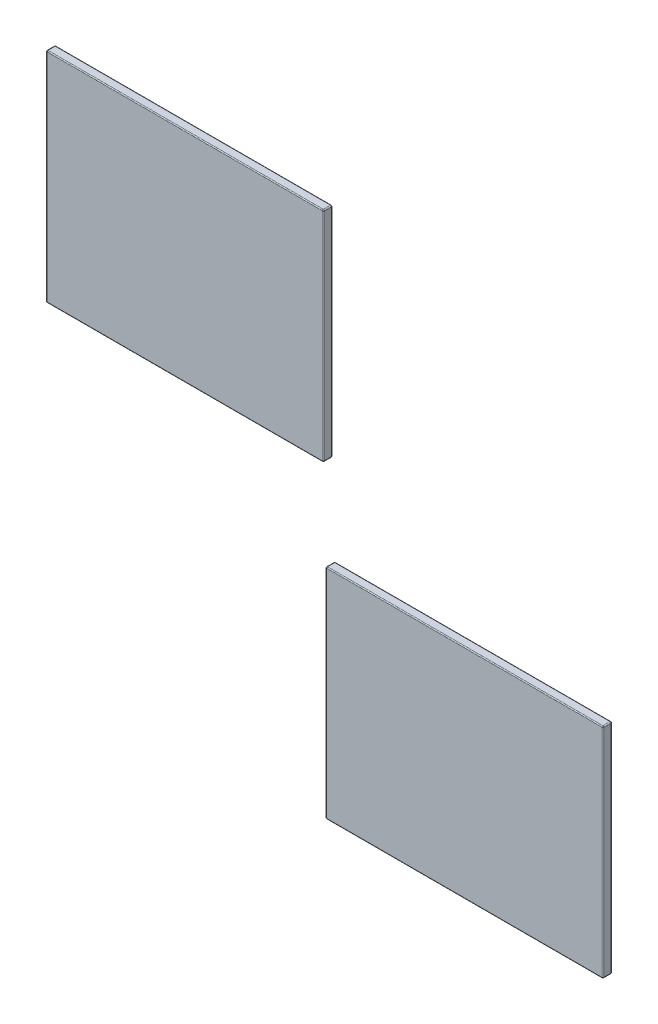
ISO-10303-21;
HEADER;
FILE_DESCRIPTION(('STEP AP214'),'2;1');
FILE_NAME('part.step','',(''),(''),'','','');
FILE_SCHEMA(('AUTOMOTIVE_DESIGN { 1 0 10303 214 1 1 1 1 }'));
ENDSEC;
DATA;
#1=APPLICATION_CONTEXT('core data for automotive mechanical design processes');
#2=APPLICATION_PROTOCOL_DEFINITION('international standard','automotive_design',2000,#1);
#3=PRODUCT_CONTEXT('',#1,'mechanical');
#4=PRODUCT('Part','Part','',(#3));
#5=PRODUCT_RELATED_PRODUCT_CATEGORY('part','',(#4));
#6=PRODUCT_DEFINITION_FORMATION('','',#4);
#7=PRODUCT_DEFINITION_CONTEXT('part definition',#1,'design');
#8=PRODUCT_DEFINITION('design','',#6,#7);
#9=PRODUCT_DEFINITION_SHAPE('','',#8);
#10=(LENGTH_UNIT() NAMED_UNIT(*) SI_UNIT(.MILLI.,.METRE.));
#11=(NAMED_UNIT(*) PLANE_ANGLE_UNIT() SI_UNIT($,.RADIAN.));
#12=(NAMED_UNIT(*) SI_UNIT($,.STERADIAN.) SOLID_ANGLE_UNIT());
#13=UNCERTAINTY_MEASURE_WITH_UNIT(LENGTH_MEASURE(1.E-05),#10,'distance_accuracy_value','');
#14=(GEOMETRIC_REPRESENTATION_CONTEXT(3) GLOBAL_UNCERTAINTY_ASSIGNED_CONTEXT((#13)) GLOBAL_UNIT_ASSIGNED_CONTEXT((#10,
#11,#12)) REPRESENTATION_CONTEXT('',''));
#15=CARTESIAN_POINT('',(0.,0.,0.));
#16=DIRECTION('',(0.,0.,1.));
#17=DIRECTION('',(1.,0.,0.));
#18=AXIS2_PLACEMENT_3D('',#15,#16,#17);
#19=CARTESIAN_POINT('',(-5.,690.,-20.));
#20=DIRECTION('',(1.,0.,0.));
#21=DIRECTION('',(0.,0.,-1.));
#22=AXIS2_PLACEMENT_3D('',#19,#20,#21);
#23=PLANE('',#22);
#24=DIRECTION('',(0.,0.,1.));
#25=VECTOR('',#24,1.);
#26=CARTESIAN_POINT('',(-5.,692.5,-20.));
#27=LINE('',#26,#25);
#28=CARTESIAN_POINT('',(-5.,692.5,-2.));
#29=VERTEX_POINT('',#28);
#30=CARTESIAN_POINT('',(-5.,692.5,-18.));
#31=VERTEX_POINT('',#30);
#32=EDGE_CURVE('E175',#29,#31,#27,.F.);
#33=ORIENTED_EDGE('',*,*,#32,.T.);
#34=DIRECTION('',(0.,1.,0.));
#35=VECTOR('',#34,1.);
#36=CARTESIAN_POINT('',(-5.,1177.5,-18.));
#37=LINE('',#36,#35);
#38=CARTESIAN_POINT('',(-5.,1177.5,-18.));
#39=VERTEX_POINT('',#38);
#40=EDGE_CURVE('E191',#31,#39,#37,.T.);
#41=ORIENTED_EDGE('',*,*,#40,.T.);
#42=DIRECTION('',(0.,0.,1.));
#43=VECTOR('',#42,1.);
#44=CARTESIAN_POINT('',(-5.,1177.5,-20.));
#45=LINE('',#44,#43);
#46=CARTESIAN_POINT('',(-5.,1177.5,-2.));
#47=VERTEX_POINT('',#46);
#48=EDGE_CURVE('E304',#39,#47,#45,.T.);
#49=ORIENTED_EDGE('',*,*,#48,.T.);
#50=DIRECTION('',(0.,1.,0.));
#51=VECTOR('',#50,1.);
#52=CARTESIAN_POINT('',(-5.,690.,-2.));
#53=LINE('',#52,#51);
#54=EDGE_CURVE('E189',#47,#29,#53,.F.);
#55=ORIENTED_EDGE('',*,*,#54,.T.);
#56=EDGE_LOOP('',(#33,#41,#49,#55));
#57=FACE_BOUND('',#56,.T.);
#58=ADVANCED_FACE('F42',(#57),#23,.T.);
#59=CARTESIAN_POINT('',(-5.,690.,-20.));
#60=DIRECTION('',(0.,-1.,0.));
#61=DIRECTION('',(0.,0.,-1.));
#62=AXIS2_PLACEMENT_3D('',#59,#60,#61);
#63=PLANE('',#62);
#64=DIRECTION('',(0.,0.,1.));
#65=VECTOR('',#64,1.);
#66=CARTESIAN_POINT('',(-625.,690.,-20.));
#67=LINE('',#66,#65);
#68=CARTESIAN_POINT('',(-625.,690.,-2.));
#69=VERTEX_POINT('',#68);
#70=CARTESIAN_POINT('',(-625.,690.,-18.));
#71=VERTEX_POINT('',#70);
#72=EDGE_CURVE('E290',#69,#71,#67,.F.);
#73=ORIENTED_EDGE('',*,*,#72,.T.);
#74=DIRECTION('',(1.,0.,0.));
#75=VECTOR('',#74,1.);
#76=CARTESIAN_POINT('',(-7.5,690.,-18.));
#77=LINE('',#76,#75);
#78=CARTESIAN_POINT('',(-7.5,690.,-18.));
#79=VERTEX_POINT('',#78);
#80=EDGE_CURVE('E216',#71,#79,#77,.T.);
#81=ORIENTED_EDGE('',*,*,#80,.T.);
#82=DIRECTION('',(0.,0.,1.));
#83=VECTOR('',#82,1.);
#84=CARTESIAN_POINT('',(-7.5,690.,-20.));
#85=LINE('',#84,#83);
#86=CARTESIAN_POINT('',(-7.5,690.,-2.));
#87=VERTEX_POINT('',#86);
#88=EDGE_CURVE('E284',#79,#87,#85,.T.);
#89=ORIENTED_EDGE('',*,*,#88,.T.);
#90=DIRECTION('',(1.,0.,0.));
#91=VECTOR('',#90,1.);
#92=CARTESIAN_POINT('',(-5.,690.,-2.));
#93=LINE('',#92,#91);
#94=EDGE_CURVE('E214',#87,#69,#93,.F.);
#95=ORIENTED_EDGE('',*,*,#94,.T.);
#96=EDGE_LOOP('',(#73,#81,#89,#95));
#97=FACE_BOUND('',#96,.T.);
#98=ADVANCED_FACE('F288',(#97),#63,.T.);
#99=CARTESIAN_POINT('',(-627.5,690.,-20.));
#100=DIRECTION('',(-1.,0.,0.));
#101=DIRECTION('',(0.,0.,1.));
#102=AXIS2_PLACEMENT_3D('',#99,#100,#101);
#103=PLANE('',#102);
#104=DIRECTION('',(0.,0.,1.));
#105=VECTOR('',#104,1.);
#106=CARTESIAN_POINT('',(-627.5,1177.5,-20.));
#107=LINE('',#106,#105);
#108=CARTESIAN_POINT('',(-627.5,1177.5,-2.));
#109=VERTEX_POINT('',#108);
#110=CARTESIAN_POINT('',(-627.5,1177.5,-18.));
#111=VERTEX_POINT('',#110);
#112=EDGE_CURVE('E247',#109,#111,#107,.F.);
#113=ORIENTED_EDGE('',*,*,#112,.T.);
#114=DIRECTION('',(0.,-1.,0.));
#115=VECTOR('',#114,1.);
#116=CARTESIAN_POINT('',(-627.5,692.5,-18.));
#117=LINE('',#116,#115);
#118=CARTESIAN_POINT('',(-627.5,692.5,-18.));
#119=VERTEX_POINT('',#118);
#120=EDGE_CURVE('E208',#111,#119,#117,.T.);
#121=ORIENTED_EDGE('',*,*,#120,.T.);
#122=DIRECTION('',(0.,0.,1.));
#123=VECTOR('',#122,1.);
#124=CARTESIAN_POINT('',(-627.5,692.5,-20.));
#125=LINE('',#124,#123);
#126=CARTESIAN_POINT('',(-627.5,692.5,-2.));
#127=VERTEX_POINT('',#126);
#128=EDGE_CURVE('E291',#119,#127,#125,.T.);
#129=ORIENTED_EDGE('',*,*,#128,.T.);
#130=DIRECTION('',(0.,-1.,0.));
#131=VECTOR('',#130,1.);
#132=CARTESIAN_POINT('',(-627.5,690.,-2.));
#133=LINE('',#132,#131);
#134=EDGE_CURVE('E206',#127,#109,#133,.F.);
#135=ORIENTED_EDGE('',*,*,#134,.T.);
#136=EDGE_LOOP('',(#113,#121,#129,#135));
#137=FACE_BOUND('',#136,.T.);
#138=ADVANCED_FACE('F354',(#137),#103,.T.);
#139=CARTESIAN_POINT('',(-5.,1180.,-20.));
#140=DIRECTION('',(0.,1.,0.));
#141=DIRECTION('',(0.,0.,1.));
#142=AXIS2_PLACEMENT_3D('',#139,#140,#141);
#143=PLANE('',#142);
#144=DIRECTION('',(0.,0.,1.));
#145=VECTOR('',#144,1.);
#146=CARTESIAN_POINT('',(-7.5,1180.,-20.));
#147=LINE('',#146,#145);
#148=CARTESIAN_POINT('',(-7.5,1180.,-2.));
#149=VERTEX_POINT('',#148);
#150=CARTESIAN_POINT('',(-7.5,1180.,-18.));
#151=VERTEX_POINT('',#150);
#152=EDGE_CURVE('E293',#149,#151,#147,.F.);
#153=ORIENTED_EDGE('',*,*,#152,.T.);
#154=DIRECTION('',(-1.,0.,0.));
#155=VECTOR('',#154,1.);
#156=CARTESIAN_POINT('',(-625.,1180.,-18.));
#157=LINE('',#156,#155);
#158=CARTESIAN_POINT('',(-625.,1180.,-18.));
#159=VERTEX_POINT('',#158);
#160=EDGE_CURVE('E199',#151,#159,#157,.T.);
#161=ORIENTED_EDGE('',*,*,#160,.T.);
#162=DIRECTION('',(0.,0.,1.));
#163=VECTOR('',#162,1.);
#164=CARTESIAN_POINT('',(-625.,1180.,-20.));
#165=LINE('',#164,#163);
#166=CARTESIAN_POINT('',(-625.,1180.,-2.));
#167=VERTEX_POINT('',#166);
#168=EDGE_CURVE('E301',#159,#167,#165,.T.);
#169=ORIENTED_EDGE('',*,*,#168,.T.);
#170=DIRECTION('',(-1.,0.,0.));
#171=VECTOR('',#170,1.);
#172=CARTESIAN_POINT('',(-5.,1180.,-2.));
#173=LINE('',#172,#171);
#174=EDGE_CURVE('E197',#167,#149,#173,.F.);
#175=ORIENTED_EDGE('',*,*,#174,.T.);
#176=EDGE_LOOP('',(#153,#161,#169,#175));
#177=FACE_BOUND('',#176,.T.);
#178=ADVANCED_FACE('F370',(#177),#143,.T.);
#179=CARTESIAN_POINT('',(-5.,1180.,-20.));
#180=DIRECTION('',(0.,0.,1.));
#181=DIRECTION('',(1.,0.,0.));
#182=AXIS2_PLACEMENT_3D('',#179,#180,#181);
#183=PLANE('',#182);
#184=DIRECTION('',(0.,1.,0.));
#185=VECTOR('',#184,1.);
#186=CARTESIAN_POINT('',(-7.,692.5,-20.));
#187=LINE('',#186,#185);
#188=CARTESIAN_POINT('',(-7.,1177.5,-20.));
#189=VERTEX_POINT('',#188);
#190=CARTESIAN_POINT('',(-7.,692.5,-20.));
#191=VERTEX_POINT('',#190);
#192=EDGE_CURVE('E179',#189,#191,#187,.F.);
#193=ORIENTED_EDGE('',*,*,#192,.T.);
#194=CARTESIAN_POINT('',(-7.5,692.5,-20.));
#195=DIRECTION('',(0.,0.,1.));
#196=DIRECTION('',(1.,0.,0.));
#197=AXIS2_PLACEMENT_3D('',#194,#195,#196);
#198=CIRCLE('',#197,0.5);
#199=CARTESIAN_POINT('',(-7.5,692.,-20.));
#200=VERTEX_POINT('',#199);
#201=EDGE_CURVE('E160',#191,#200,#198,.F.);
#202=ORIENTED_EDGE('',*,*,#201,.T.);
#203=DIRECTION('',(1.,0.,0.));
#204=VECTOR('',#203,1.);
#205=CARTESIAN_POINT('',(-625.,692.,-20.));
#206=LINE('',#205,#204);
#207=CARTESIAN_POINT('',(-625.,692.,-20.));
#208=VERTEX_POINT('',#207);
#209=EDGE_CURVE('E168',#200,#208,#206,.F.);
#210=ORIENTED_EDGE('',*,*,#209,.T.);
#211=CARTESIAN_POINT('',(-625.,692.5,-20.));
#212=DIRECTION('',(0.,0.,1.));
#213=DIRECTION('',(1.,0.,0.));
#214=AXIS2_PLACEMENT_3D('',#211,#212,#213);
#215=CIRCLE('',#214,0.5);
#216=CARTESIAN_POINT('',(-625.5,692.5,-20.));
#217=VERTEX_POINT('',#216);
#218=EDGE_CURVE('E174',#208,#217,#215,.F.);
#219=ORIENTED_EDGE('',*,*,#218,.T.);
#220=DIRECTION('',(0.,-1.,0.));
#221=VECTOR('',#220,1.);
#222=CARTESIAN_POINT('',(-625.5,1177.5,-20.));
#223=LINE('',#222,#221);
#224=CARTESIAN_POINT('',(-625.5,1177.5,-20.));
#225=VERTEX_POINT('',#224);
#226=EDGE_CURVE('E309',#217,#225,#223,.F.);
#227=ORIENTED_EDGE('',*,*,#226,.T.);
#228=CARTESIAN_POINT('',(-625.,1177.5,-20.));
#229=DIRECTION('',(0.,0.,1.));
#230=DIRECTION('',(1.,0.,0.));
#231=AXIS2_PLACEMENT_3D('',#228,#229,#230);
#232=CIRCLE('',#231,0.5);
#233=CARTESIAN_POINT('',(-625.,1178.,-20.));
#234=VERTEX_POINT('',#233);
#235=EDGE_CURVE('E311',#225,#234,#232,.F.);
#236=ORIENTED_EDGE('',*,*,#235,.T.);
#237=DIRECTION('',(-1.,0.,0.));
#238=VECTOR('',#237,1.);
#239=CARTESIAN_POINT('',(-7.5,1178.,-20.));
#240=LINE('',#239,#238);
#241=CARTESIAN_POINT('',(-7.5,1178.,-20.));
#242=VERTEX_POINT('',#241);
#243=EDGE_CURVE('E313',#234,#242,#240,.F.);
#244=ORIENTED_EDGE('',*,*,#243,.T.);
#245=CARTESIAN_POINT('',(-7.5,1177.5,-20.));
#246=DIRECTION('',(0.,0.,1.));
#247=DIRECTION('',(1.,0.,0.));
#248=AXIS2_PLACEMENT_3D('',#245,#246,#247);
#249=CIRCLE('',#248,0.5);
#250=EDGE_CURVE('E184',#242,#189,#249,.F.);
#251=ORIENTED_EDGE('',*,*,#250,.T.);
#252=EDGE_LOOP('',(#193,#202,#210,#219,#227,#236,#244,#251));
#253=FACE_BOUND('',#252,.T.);
#254=ADVANCED_FACE('F177',(#253),#183,.F.);
#255=CARTESIAN_POINT('',(-5.,1180.,0.));
#256=DIRECTION('',(0.,0.,1.));
#257=DIRECTION('',(1.,0.,0.));
#258=AXIS2_PLACEMENT_3D('',#255,#256,#257);
#259=PLANE('',#258);
#260=DIRECTION('',(-1.,0.,0.));
#261=VECTOR('',#260,1.);
#262=CARTESIAN_POINT('',(-5.,1178.,0.));
#263=LINE('',#262,#261);
#264=CARTESIAN_POINT('',(-7.5,1178.,0.));
#265=VERTEX_POINT('',#264);
#266=CARTESIAN_POINT('',(-625.,1178.,0.));
#267=VERTEX_POINT('',#266);
#268=EDGE_CURVE('E51',#265,#267,#263,.T.);
#269=ORIENTED_EDGE('',*,*,#268,.T.);
#270=CARTESIAN_POINT('',(-625.,1177.5,0.));
#271=DIRECTION('',(0.,0.,1.));
#272=DIRECTION('',(1.,0.,0.));
#273=AXIS2_PLACEMENT_3D('',#270,#271,#272);
#274=CIRCLE('',#273,0.5);
#275=CARTESIAN_POINT('',(-625.5,1177.5,0.));
#276=VERTEX_POINT('',#275);
#277=EDGE_CURVE('E12',#267,#276,#274,.T.);
#278=ORIENTED_EDGE('',*,*,#277,.T.);
#279=DIRECTION('',(0.,-1.,0.));
#280=VECTOR('',#279,1.);
#281=CARTESIAN_POINT('',(-625.5,1180.,0.));
#282=LINE('',#281,#280);
#283=CARTESIAN_POINT('',(-625.5,692.5,0.));
#284=VERTEX_POINT('',#283);
#285=EDGE_CURVE('E218',#276,#284,#282,.T.);
#286=ORIENTED_EDGE('',*,*,#285,.T.);
#287=CARTESIAN_POINT('',(-625.,692.5,0.));
#288=DIRECTION('',(0.,0.,1.));
#289=DIRECTION('',(1.,0.,0.));
#290=AXIS2_PLACEMENT_3D('',#287,#288,#289);
#291=CIRCLE('',#290,0.5);
#292=CARTESIAN_POINT('',(-625.,692.,0.));
#293=VERTEX_POINT('',#292);
#294=EDGE_CURVE('E220',#284,#293,#291,.T.);
#295=ORIENTED_EDGE('',*,*,#294,.T.);
#296=DIRECTION('',(1.,0.,0.));
#297=VECTOR('',#296,1.);
#298=CARTESIAN_POINT('',(-5.,692.,0.));
#299=LINE('',#298,#297);
#300=CARTESIAN_POINT('',(-7.5,692.,0.));
#301=VERTEX_POINT('',#300);
#302=EDGE_CURVE('E222',#293,#301,#299,.T.);
#303=ORIENTED_EDGE('',*,*,#302,.T.);
#304=CARTESIAN_POINT('',(-7.5,692.5,0.));
#305=DIRECTION('',(0.,0.,1.));
#306=DIRECTION('',(1.,0.,0.));
#307=AXIS2_PLACEMENT_3D('',#304,#305,#306);
#308=CIRCLE('',#307,0.5);
#309=CARTESIAN_POINT('',(-7.,692.5,0.));
#310=VERTEX_POINT('',#309);
#311=EDGE_CURVE('E224',#301,#310,#308,.T.);
#312=ORIENTED_EDGE('',*,*,#311,.T.);
#313=DIRECTION('',(0.,1.,0.));
#314=VECTOR('',#313,1.);
#315=CARTESIAN_POINT('',(-7.,1180.,0.));
#316=LINE('',#315,#314);
#317=CARTESIAN_POINT('',(-7.,1177.5,0.));
#318=VERTEX_POINT('',#317);
#319=EDGE_CURVE('E226',#310,#318,#316,.T.);
#320=ORIENTED_EDGE('',*,*,#319,.T.);
#321=CARTESIAN_POINT('',(-7.5,1177.5,0.));
#322=DIRECTION('',(0.,0.,1.));
#323=DIRECTION('',(1.,0.,0.));
#324=AXIS2_PLACEMENT_3D('',#321,#322,#323);
#325=CIRCLE('',#324,0.5);
#326=EDGE_CURVE('E62',#318,#265,#325,.T.);
#327=ORIENTED_EDGE('',*,*,#326,.T.);
#328=EDGE_LOOP('',(#269,#278,#286,#295,#303,#312,#320,#327));
#329=FACE_BOUND('',#328,.T.);
#330=ADVANCED_FACE('F341',(#329),#259,.T.);
#331=CARTESIAN_POINT('',(-625.,692.5,-20.));
#332=DIRECTION('',(0.,0.,1.));
#333=DIRECTION('',(1.,0.,0.));
#334=AXIS2_PLACEMENT_3D('',#331,#332,#333);
#335=CYLINDRICAL_SURFACE('',#334,2.5);
#336=ORIENTED_EDGE('',*,*,#128,.F.);
#337=CARTESIAN_POINT('',(-625.,692.5,-18.));
#338=DIRECTION('',(0.,0.,1.));
#339=DIRECTION('',(1.,0.,0.));
#340=AXIS2_PLACEMENT_3D('',#337,#338,#339);
#341=CIRCLE('',#340,2.5);
#342=EDGE_CURVE('E212',#119,#71,#341,.T.);
#343=ORIENTED_EDGE('',*,*,#342,.T.);
#344=ORIENTED_EDGE('',*,*,#72,.F.);
#345=CARTESIAN_POINT('',(-625.,692.5,-2.));
#346=DIRECTION('',(0.,0.,1.));
#347=DIRECTION('',(1.,0.,0.));
#348=AXIS2_PLACEMENT_3D('',#345,#346,#347);
#349=CIRCLE('',#348,2.5);
#350=EDGE_CURVE('E210',#69,#127,#349,.F.);
#351=ORIENTED_EDGE('',*,*,#350,.T.);
#352=EDGE_LOOP('',(#336,#343,#344,#351));
#353=FACE_BOUND('',#352,.T.);
#354=ADVANCED_FACE('F386',(#353),#335,.T.);
#355=CARTESIAN_POINT('',(-625.,1177.5,-20.));
#356=DIRECTION('',(0.,0.,1.));
#357=DIRECTION('',(1.,0.,0.));
#358=AXIS2_PLACEMENT_3D('',#355,#356,#357);
#359=CYLINDRICAL_SURFACE('',#358,2.5);
#360=ORIENTED_EDGE('',*,*,#168,.F.);
#361=CARTESIAN_POINT('',(-625.,1177.5,-18.));
#362=DIRECTION('',(0.,0.,1.));
#363=DIRECTION('',(1.,0.,0.));
#364=AXIS2_PLACEMENT_3D('',#361,#362,#363);
#365=CIRCLE('',#364,2.5);
#366=EDGE_CURVE('E204',#159,#111,#365,.T.);
#367=ORIENTED_EDGE('',*,*,#366,.T.);
#368=ORIENTED_EDGE('',*,*,#112,.F.);
#369=CARTESIAN_POINT('',(-625.,1177.5,-2.));
#370=DIRECTION('',(0.,0.,1.));
#371=DIRECTION('',(1.,0.,0.));
#372=AXIS2_PLACEMENT_3D('',#369,#370,#371);
#373=CIRCLE('',#372,2.5);
#374=EDGE_CURVE('E201',#109,#167,#373,.F.);
#375=ORIENTED_EDGE('',*,*,#374,.T.);
#376=EDGE_LOOP('',(#360,#367,#368,#375));
#377=FACE_BOUND('',#376,.T.);
#378=ADVANCED_FACE('F359',(#377),#359,.T.);
#379=CARTESIAN_POINT('',(-7.5,692.5,-20.));
#380=DIRECTION('',(0.,0.,1.));
#381=DIRECTION('',(1.,0.,0.));
#382=AXIS2_PLACEMENT_3D('',#379,#380,#381);
#383=CYLINDRICAL_SURFACE('',#382,2.5);
#384=ORIENTED_EDGE('',*,*,#88,.F.);
#385=CARTESIAN_POINT('',(-7.5,692.5,-18.));
#386=DIRECTION('',(0.,0.,1.));
#387=DIRECTION('',(1.,0.,0.));
#388=AXIS2_PLACEMENT_3D('',#385,#386,#387);
#389=CIRCLE('',#388,2.5);
#390=EDGE_CURVE('E162',#79,#31,#389,.T.);
#391=ORIENTED_EDGE('',*,*,#390,.T.);
#392=ORIENTED_EDGE('',*,*,#32,.F.);
#393=CARTESIAN_POINT('',(-7.5,692.5,-2.));
#394=DIRECTION('',(0.,0.,1.));
#395=DIRECTION('',(1.,0.,0.));
#396=AXIS2_PLACEMENT_3D('',#393,#394,#395);
#397=CIRCLE('',#396,2.5);
#398=EDGE_CURVE('E181',#29,#87,#397,.F.);
#399=ORIENTED_EDGE('',*,*,#398,.T.);
#400=EDGE_LOOP('',(#384,#391,#392,#399));
#401=FACE_BOUND('',#400,.T.);
#402=ADVANCED_FACE('F283',(#401),#383,.T.);
#403=CARTESIAN_POINT('',(-7.5,1177.5,-20.));
#404=DIRECTION('',(0.,0.,1.));
#405=DIRECTION('',(1.,0.,0.));
#406=AXIS2_PLACEMENT_3D('',#403,#404,#405);
#407=CYLINDRICAL_SURFACE('',#406,2.5);
#408=ORIENTED_EDGE('',*,*,#48,.F.);
#409=CARTESIAN_POINT('',(-7.5,1177.5,-18.));
#410=DIRECTION('',(0.,0.,1.));
#411=DIRECTION('',(1.,0.,0.));
#412=AXIS2_PLACEMENT_3D('',#409,#410,#411);
#413=CIRCLE('',#412,2.5);
#414=EDGE_CURVE('E195',#39,#151,#413,.T.);
#415=ORIENTED_EDGE('',*,*,#414,.T.);
#416=ORIENTED_EDGE('',*,*,#152,.F.);
#417=CARTESIAN_POINT('',(-7.5,1177.5,-2.));
#418=DIRECTION('',(0.,0.,1.));
#419=DIRECTION('',(1.,0.,0.));
#420=AXIS2_PLACEMENT_3D('',#417,#418,#419);
#421=CIRCLE('',#420,2.5);
#422=EDGE_CURVE('E193',#149,#47,#421,.F.);
#423=ORIENTED_EDGE('',*,*,#422,.T.);
#424=EDGE_LOOP('',(#408,#415,#416,#423));
#425=FACE_BOUND('',#424,.T.);
#426=ADVANCED_FACE('F327',(#425),#407,.T.);
#427=CARTESIAN_POINT('',(-625.,1177.5,-18.));
#428=DIRECTION('',(0.,0.,1.));
#429=DIRECTION('',(1.,0.,0.));
#430=AXIS2_PLACEMENT_3D('',#427,#428,#429);
#431=DEGENERATE_TOROIDAL_SURFACE('',#430,0.5,2.,.T.);
#432=CARTESIAN_POINT('',(-625.5,1177.5,-18.));
#433=DIRECTION('',(0.,-1.,0.));
#434=DIRECTION('',(0.,0.,-1.));
#435=AXIS2_PLACEMENT_3D('',#432,#433,#434);
#436=CIRCLE('',#435,2.);
#437=EDGE_CURVE('E241',#111,#225,#436,.T.);
#438=ORIENTED_EDGE('',*,*,#437,.F.);
#439=ORIENTED_EDGE('',*,*,#366,.F.);
#440=CARTESIAN_POINT('',(-625.,1178.,-18.));
#441=DIRECTION('',(1.,0.,0.));
#442=DIRECTION('',(0.,0.,-1.));
#443=AXIS2_PLACEMENT_3D('',#440,#441,#442);
#444=CIRCLE('',#443,2.);
#445=EDGE_CURVE('E244',#234,#159,#444,.T.);
#446=ORIENTED_EDGE('',*,*,#445,.F.);
#447=ORIENTED_EDGE('',*,*,#235,.F.);
#448=EDGE_LOOP('',(#438,#439,#446,#447));
#449=FACE_BOUND('',#448,.T.);
#450=ADVANCED_FACE('F363',(#449),#431,.T.);
#451=CARTESIAN_POINT('',(-5.,1178.,-18.));
#452=DIRECTION('',(1.,0.,0.));
#453=DIRECTION('',(0.,0.,-1.));
#454=AXIS2_PLACEMENT_3D('',#451,#452,#453);
#455=CYLINDRICAL_SURFACE('',#454,2.);
#456=ORIENTED_EDGE('',*,*,#445,.T.);
#457=ORIENTED_EDGE('',*,*,#160,.F.);
#458=CARTESIAN_POINT('',(-7.5,1178.,-18.));
#459=DIRECTION('',(1.,0.,0.));
#460=DIRECTION('',(0.,0.,-1.));
#461=AXIS2_PLACEMENT_3D('',#458,#459,#460);
#462=CIRCLE('',#461,2.);
#463=EDGE_CURVE('E238',#242,#151,#462,.T.);
#464=ORIENTED_EDGE('',*,*,#463,.F.);
#465=ORIENTED_EDGE('',*,*,#243,.F.);
#466=EDGE_LOOP('',(#456,#457,#464,#465));
#467=FACE_BOUND('',#466,.T.);
#468=ADVANCED_FACE('F368',(#467),#455,.T.);
#469=CARTESIAN_POINT('',(-625.5,690.,-18.));
#470=DIRECTION('',(0.,1.,0.));
#471=DIRECTION('',(0.,0.,1.));
#472=AXIS2_PLACEMENT_3D('',#469,#470,#471);
#473=CYLINDRICAL_SURFACE('',#472,2.);
#474=ORIENTED_EDGE('',*,*,#437,.T.);
#475=ORIENTED_EDGE('',*,*,#226,.F.);
#476=CARTESIAN_POINT('',(-625.5,692.5,-18.));
#477=DIRECTION('',(0.,-1.,0.));
#478=DIRECTION('',(0.,0.,-1.));
#479=AXIS2_PLACEMENT_3D('',#476,#477,#478);
#480=CIRCLE('',#479,2.);
#481=EDGE_CURVE('E235',#119,#217,#480,.T.);
#482=ORIENTED_EDGE('',*,*,#481,.F.);
#483=ORIENTED_EDGE('',*,*,#120,.F.);
#484=EDGE_LOOP('',(#474,#475,#482,#483));
#485=FACE_BOUND('',#484,.T.);
#486=ADVANCED_FACE('F408',(#485),#473,.T.);
#487=CARTESIAN_POINT('',(-7.5,1177.5,-18.));
#488=DIRECTION('',(0.,0.,1.));
#489=DIRECTION('',(1.,0.,0.));
#490=AXIS2_PLACEMENT_3D('',#487,#488,#489);
#491=DEGENERATE_TOROIDAL_SURFACE('',#490,0.5,2.,.T.);
#492=ORIENTED_EDGE('',*,*,#463,.T.);
#493=ORIENTED_EDGE('',*,*,#414,.F.);
#494=CARTESIAN_POINT('',(-7.,1177.5,-18.));
#495=DIRECTION('',(0.,-1.,0.));
#496=DIRECTION('',(0.,0.,-1.));
#497=AXIS2_PLACEMENT_3D('',#494,#495,#496);
#498=CIRCLE('',#497,2.);
#499=EDGE_CURVE('E232',#189,#39,#498,.T.);
#500=ORIENTED_EDGE('',*,*,#499,.F.);
#501=ORIENTED_EDGE('',*,*,#250,.F.);
#502=EDGE_LOOP('',(#492,#493,#500,#501));
#503=FACE_BOUND('',#502,.T.);
#504=ADVANCED_FACE('F320',(#503),#491,.T.);
#505=CARTESIAN_POINT('',(-625.,692.5,-18.));
#506=DIRECTION('',(0.,0.,1.));
#507=DIRECTION('',(1.,0.,0.));
#508=AXIS2_PLACEMENT_3D('',#505,#506,#507);
#509=DEGENERATE_TOROIDAL_SURFACE('',#508,0.5,2.,.T.);
#510=ORIENTED_EDGE('',*,*,#481,.T.);
#511=ORIENTED_EDGE('',*,*,#218,.F.);
#512=CARTESIAN_POINT('',(-625.,692.,-18.));
#513=DIRECTION('',(1.,0.,0.));
#514=DIRECTION('',(0.,0.,-1.));
#515=AXIS2_PLACEMENT_3D('',#512,#513,#514);
#516=CIRCLE('',#515,2.);
#517=EDGE_CURVE('E171',#71,#208,#516,.T.);
#518=ORIENTED_EDGE('',*,*,#517,.F.);
#519=ORIENTED_EDGE('',*,*,#342,.F.);
#520=EDGE_LOOP('',(#510,#511,#518,#519));
#521=FACE_BOUND('',#520,.T.);
#522=ADVANCED_FACE('F402',(#521),#509,.T.);
#523=CARTESIAN_POINT('',(-7.,690.,-18.));
#524=DIRECTION('',(0.,-1.,0.));
#525=DIRECTION('',(0.,0.,-1.));
#526=AXIS2_PLACEMENT_3D('',#523,#524,#525);
#527=CYLINDRICAL_SURFACE('',#526,2.);
#528=ORIENTED_EDGE('',*,*,#499,.T.);
#529=ORIENTED_EDGE('',*,*,#40,.F.);
#530=CARTESIAN_POINT('',(-7.,692.5,-18.));
#531=DIRECTION('',(0.,-1.,0.));
#532=DIRECTION('',(0.,0.,-1.));
#533=AXIS2_PLACEMENT_3D('',#530,#531,#532);
#534=CIRCLE('',#533,2.);
#535=EDGE_CURVE('E165',#191,#31,#534,.T.);
#536=ORIENTED_EDGE('',*,*,#535,.F.);
#537=ORIENTED_EDGE('',*,*,#192,.F.);
#538=EDGE_LOOP('',(#528,#529,#536,#537));
#539=FACE_BOUND('',#538,.T.);
#540=ADVANCED_FACE('F323',(#539),#527,.T.);
#541=CARTESIAN_POINT('',(-5.,692.,-18.));
#542=DIRECTION('',(-1.,0.,0.));
#543=DIRECTION('',(0.,0.,1.));
#544=AXIS2_PLACEMENT_3D('',#541,#542,#543);
#545=CYLINDRICAL_SURFACE('',#544,2.);
#546=ORIENTED_EDGE('',*,*,#517,.T.);
#547=ORIENTED_EDGE('',*,*,#209,.F.);
#548=CARTESIAN_POINT('',(-7.5,692.,-18.));
#549=DIRECTION('',(1.,0.,0.));
#550=DIRECTION('',(0.,0.,-1.));
#551=AXIS2_PLACEMENT_3D('',#548,#549,#550);
#552=CIRCLE('',#551,2.);
#553=EDGE_CURVE('E156',#79,#200,#552,.T.);
#554=ORIENTED_EDGE('',*,*,#553,.F.);
#555=ORIENTED_EDGE('',*,*,#80,.F.);
#556=EDGE_LOOP('',(#546,#547,#554,#555));
#557=FACE_BOUND('',#556,.T.);
#558=ADVANCED_FACE('F169',(#557),#545,.T.);
#559=CARTESIAN_POINT('',(-7.5,692.5,-18.));
#560=DIRECTION('',(0.,0.,1.));
#561=DIRECTION('',(1.,0.,0.));
#562=AXIS2_PLACEMENT_3D('',#559,#560,#561);
#563=DEGENERATE_TOROIDAL_SURFACE('',#562,0.5,2.,.T.);
#564=ORIENTED_EDGE('',*,*,#535,.T.);
#565=ORIENTED_EDGE('',*,*,#390,.F.);
#566=ORIENTED_EDGE('',*,*,#553,.T.);
#567=ORIENTED_EDGE('',*,*,#201,.F.);
#568=EDGE_LOOP('',(#564,#565,#566,#567));
#569=FACE_BOUND('',#568,.T.);
#570=ADVANCED_FACE('F158',(#569),#563,.T.);
#571=CARTESIAN_POINT('',(-7.5,692.5,-2.));
#572=DIRECTION('',(0.,0.,1.));
#573=DIRECTION('',(1.,0.,0.));
#574=AXIS2_PLACEMENT_3D('',#571,#572,#573);
#575=DEGENERATE_TOROIDAL_SURFACE('',#574,0.5,2.,.T.);
#576=CARTESIAN_POINT('',(-7.5,692.,-2.));
#577=DIRECTION('',(-1.,0.,0.));
#578=DIRECTION('',(0.,0.,1.));
#579=AXIS2_PLACEMENT_3D('',#576,#577,#578);
#580=CIRCLE('',#579,2.);
#581=EDGE_CURVE('E263',#87,#301,#580,.T.);
#582=ORIENTED_EDGE('',*,*,#581,.F.);
#583=ORIENTED_EDGE('',*,*,#398,.F.);
#584=CARTESIAN_POINT('',(-7.,692.5,-2.));
#585=DIRECTION('',(0.,1.,0.));
#586=DIRECTION('',(0.,0.,1.));
#587=AXIS2_PLACEMENT_3D('',#584,#585,#586);
#588=CIRCLE('',#587,2.);
#589=EDGE_CURVE('E46',#310,#29,#588,.T.);
#590=ORIENTED_EDGE('',*,*,#589,.F.);
#591=ORIENTED_EDGE('',*,*,#311,.F.);
#592=EDGE_LOOP('',(#582,#583,#590,#591));
#593=FACE_BOUND('',#592,.T.);
#594=ADVANCED_FACE('F44',(#593),#575,.T.);
#595=CARTESIAN_POINT('',(-7.,1180.,-2.));
#596=DIRECTION('',(0.,1.,0.));
#597=DIRECTION('',(0.,0.,1.));
#598=AXIS2_PLACEMENT_3D('',#595,#596,#597);
#599=CYLINDRICAL_SURFACE('',#598,2.);
#600=ORIENTED_EDGE('',*,*,#589,.T.);
#601=ORIENTED_EDGE('',*,*,#54,.F.);
#602=CARTESIAN_POINT('',(-7.,1177.5,-2.));
#603=DIRECTION('',(0.,1.,0.));
#604=DIRECTION('',(0.,0.,1.));
#605=AXIS2_PLACEMENT_3D('',#602,#603,#604);
#606=CIRCLE('',#605,2.);
#607=EDGE_CURVE('E261',#318,#47,#606,.T.);
#608=ORIENTED_EDGE('',*,*,#607,.F.);
#609=ORIENTED_EDGE('',*,*,#319,.F.);
#610=EDGE_LOOP('',(#600,#601,#608,#609));
#611=FACE_BOUND('',#610,.T.);
#612=ADVANCED_FACE('F274',(#611),#599,.T.);
#613=CARTESIAN_POINT('',(-5.,692.,-2.));
#614=DIRECTION('',(1.,0.,0.));
#615=DIRECTION('',(0.,0.,-1.));
#616=AXIS2_PLACEMENT_3D('',#613,#614,#615);
#617=CYLINDRICAL_SURFACE('',#616,2.);
#618=ORIENTED_EDGE('',*,*,#581,.T.);
#619=ORIENTED_EDGE('',*,*,#302,.F.);
#620=CARTESIAN_POINT('',(-625.,692.,-2.));
#621=DIRECTION('',(-1.,0.,0.));
#622=DIRECTION('',(0.,0.,1.));
#623=AXIS2_PLACEMENT_3D('',#620,#621,#622);
#624=CIRCLE('',#623,2.);
#625=EDGE_CURVE('E258',#69,#293,#624,.T.);
#626=ORIENTED_EDGE('',*,*,#625,.F.);
#627=ORIENTED_EDGE('',*,*,#94,.F.);
#628=EDGE_LOOP('',(#618,#619,#626,#627));
#629=FACE_BOUND('',#628,.T.);
#630=ADVANCED_FACE('F426',(#629),#617,.T.);
#631=CARTESIAN_POINT('',(-7.5,1177.5,-2.));
#632=DIRECTION('',(0.,0.,1.));
#633=DIRECTION('',(1.,0.,0.));
#634=AXIS2_PLACEMENT_3D('',#631,#632,#633);
#635=DEGENERATE_TOROIDAL_SURFACE('',#634,0.5,2.,.T.);
#636=ORIENTED_EDGE('',*,*,#607,.T.);
#637=ORIENTED_EDGE('',*,*,#422,.F.);
#638=CARTESIAN_POINT('',(-7.5,1178.,-2.));
#639=DIRECTION('',(-1.,0.,0.));
#640=DIRECTION('',(0.,0.,1.));
#641=AXIS2_PLACEMENT_3D('',#638,#639,#640);
#642=CIRCLE('',#641,2.);
#643=EDGE_CURVE('E255',#265,#149,#642,.T.);
#644=ORIENTED_EDGE('',*,*,#643,.F.);
#645=ORIENTED_EDGE('',*,*,#326,.F.);
#646=EDGE_LOOP('',(#636,#637,#644,#645));
#647=FACE_BOUND('',#646,.T.);
#648=ADVANCED_FACE('F331',(#647),#635,.T.);
#649=CARTESIAN_POINT('',(-625.,692.5,-2.));
#650=DIRECTION('',(0.,0.,1.));
#651=DIRECTION('',(1.,0.,0.));
#652=AXIS2_PLACEMENT_3D('',#649,#650,#651);
#653=DEGENERATE_TOROIDAL_SURFACE('',#652,0.5,2.,.T.);
#654=ORIENTED_EDGE('',*,*,#625,.T.);
#655=ORIENTED_EDGE('',*,*,#294,.F.);
#656=CARTESIAN_POINT('',(-625.5,692.5,-2.));
#657=DIRECTION('',(0.,1.,0.));
#658=DIRECTION('',(0.,0.,1.));
#659=AXIS2_PLACEMENT_3D('',#656,#657,#658);
#660=CIRCLE('',#659,2.);
#661=EDGE_CURVE('E252',#127,#284,#660,.T.);
#662=ORIENTED_EDGE('',*,*,#661,.F.);
#663=ORIENTED_EDGE('',*,*,#350,.F.);
#664=EDGE_LOOP('',(#654,#655,#662,#663));
#665=FACE_BOUND('',#664,.T.);
#666=ADVANCED_FACE('F346',(#665),#653,.T.);
#667=CARTESIAN_POINT('',(-5.,1178.,-2.));
#668=DIRECTION('',(-1.,0.,0.));
#669=DIRECTION('',(0.,0.,1.));
#670=AXIS2_PLACEMENT_3D('',#667,#668,#669);
#671=CYLINDRICAL_SURFACE('',#670,2.);
#672=ORIENTED_EDGE('',*,*,#643,.T.);
#673=ORIENTED_EDGE('',*,*,#174,.F.);
#674=CARTESIAN_POINT('',(-625.,1178.,-2.));
#675=DIRECTION('',(-1.,0.,0.));
#676=DIRECTION('',(0.,0.,1.));
#677=AXIS2_PLACEMENT_3D('',#674,#675,#676);
#678=CIRCLE('',#677,2.);
#679=EDGE_CURVE('E250',#267,#167,#678,.T.);
#680=ORIENTED_EDGE('',*,*,#679,.F.);
#681=ORIENTED_EDGE('',*,*,#268,.F.);
#682=EDGE_LOOP('',(#672,#673,#680,#681));
#683=FACE_BOUND('',#682,.T.);
#684=ADVANCED_FACE('F334',(#683),#671,.T.);
#685=CARTESIAN_POINT('',(-625.5,1180.,-2.));
#686=DIRECTION('',(0.,-1.,0.));
#687=DIRECTION('',(0.,0.,-1.));
#688=AXIS2_PLACEMENT_3D('',#685,#686,#687);
#689=CYLINDRICAL_SURFACE('',#688,2.);
#690=ORIENTED_EDGE('',*,*,#661,.T.);
#691=ORIENTED_EDGE('',*,*,#285,.F.);
#692=CARTESIAN_POINT('',(-625.5,1177.5,-2.));
#693=DIRECTION('',(0.,1.,0.));
#694=DIRECTION('',(0.,0.,1.));
#695=AXIS2_PLACEMENT_3D('',#692,#693,#694);
#696=CIRCLE('',#695,2.);
#697=EDGE_CURVE('E248',#109,#276,#696,.T.);
#698=ORIENTED_EDGE('',*,*,#697,.F.);
#699=ORIENTED_EDGE('',*,*,#134,.F.);
#700=EDGE_LOOP('',(#690,#691,#698,#699));
#701=FACE_BOUND('',#700,.T.);
#702=ADVANCED_FACE('F350',(#701),#689,.T.);
#703=CARTESIAN_POINT('',(-625.,1177.5,-2.));
#704=DIRECTION('',(0.,0.,1.));
#705=DIRECTION('',(1.,0.,0.));
#706=AXIS2_PLACEMENT_3D('',#703,#704,#705);
#707=DEGENERATE_TOROIDAL_SURFACE('',#706,0.5,2.,.T.);
#708=ORIENTED_EDGE('',*,*,#679,.T.);
#709=ORIENTED_EDGE('',*,*,#374,.F.);
#710=ORIENTED_EDGE('',*,*,#697,.T.);
#711=ORIENTED_EDGE('',*,*,#277,.F.);
#712=EDGE_LOOP('',(#708,#709,#710,#711));
#713=FACE_BOUND('',#712,.T.);
#714=ADVANCED_FACE('F338',(#713),#707,.T.);
#715=CLOSED_SHELL('',(#58,#98,#138,#178,#254,#330,#354,#378,#402,#426,#450,#468,#486,#504,#522,
#540,#558,#570,#594,#612,#630,#648,#666,#684,#702,#714));
#716=MANIFOLD_SOLID_BREP('B2',#715);
#717=CARTESIAN_POINT('',(0.,0.,-20.));
#718=DIRECTION('',(-1.,0.,0.));
#719=DIRECTION('',(0.,0.,1.));
#720=AXIS2_PLACEMENT_3D('',#717,#718,#719);
#721=PLANE('',#720);
#722=DIRECTION('',(0.,0.,1.));
#723=VECTOR('',#722,1.);
#724=CARTESIAN_POINT('',(0.,487.5,-20.));
#725=LINE('',#724,#723);
#726=CARTESIAN_POINT('',(0.,487.5,-2.));
#727=VERTEX_POINT('',#726);
#728=CARTESIAN_POINT('',(0.,487.5,-18.));
#729=VERTEX_POINT('',#728);
#730=EDGE_CURVE('E857',#727,#729,#725,.F.);
#731=ORIENTED_EDGE('',*,*,#730,.T.);
#732=DIRECTION('',(0.,-1.,0.));
#733=VECTOR('',#732,1.);
#734=CARTESIAN_POINT('',(0.,0.,-18.));
#735=LINE('',#734,#733);
#736=CARTESIAN_POINT('',(0.,2.5,-18.));
#737=VERTEX_POINT('',#736);
#738=EDGE_CURVE('E762',#729,#737,#735,.T.);
#739=ORIENTED_EDGE('',*,*,#738,.T.);
#740=DIRECTION('',(0.,0.,1.));
#741=VECTOR('',#740,1.);
#742=CARTESIAN_POINT('',(0.,2.5,-20.));
#743=LINE('',#742,#741);
#744=CARTESIAN_POINT('',(0.,2.5,-2.));
#745=VERTEX_POINT('',#744);
#746=EDGE_CURVE('E865',#737,#745,#743,.T.);
#747=ORIENTED_EDGE('',*,*,#746,.T.);
#748=DIRECTION('',(0.,-1.,0.));
#749=VECTOR('',#748,1.);
#750=CARTESIAN_POINT('',(0.,487.5,-2.));
#751=LINE('',#750,#749);
#752=EDGE_CURVE('E760',#745,#727,#751,.F.);
#753=ORIENTED_EDGE('',*,*,#752,.T.);
#754=EDGE_LOOP('',(#731,#739,#747,#753));
#755=FACE_BOUND('',#754,.T.);
#756=ADVANCED_FACE('F605',(#755),#721,.T.);
#757=CARTESIAN_POINT('',(0.,490.,-20.));
#758=DIRECTION('',(0.,1.,0.));
#759=DIRECTION('',(0.,0.,1.));
#760=AXIS2_PLACEMENT_3D('',#757,#758,#759);
#761=PLANE('',#760);
#762=DIRECTION('',(0.,0.,1.));
#763=VECTOR('',#762,1.);
#764=CARTESIAN_POINT('',(620.,490.,-20.));
#765=LINE('',#764,#763);
#766=CARTESIAN_POINT('',(620.,490.,-2.));
#767=VERTEX_POINT('',#766);
#768=CARTESIAN_POINT('',(620.,490.,-18.));
#769=VERTEX_POINT('',#768);
#770=EDGE_CURVE('E849',#767,#769,#765,.F.);
#771=ORIENTED_EDGE('',*,*,#770,.T.);
#772=DIRECTION('',(-1.,0.,0.));
#773=VECTOR('',#772,1.);
#774=CARTESIAN_POINT('',(0.,490.,-18.));
#775=LINE('',#774,#773);
#776=CARTESIAN_POINT('',(2.5,490.,-18.));
#777=VERTEX_POINT('',#776);
#778=EDGE_CURVE('E754',#769,#777,#775,.T.);
#779=ORIENTED_EDGE('',*,*,#778,.T.);
#780=DIRECTION('',(0.,0.,1.));
#781=VECTOR('',#780,1.);
#782=CARTESIAN_POINT('',(2.5,490.,-20.));
#783=LINE('',#782,#781);
#784=CARTESIAN_POINT('',(2.5,490.,-2.));
#785=VERTEX_POINT('',#784);
#786=EDGE_CURVE('E738',#777,#785,#783,.T.);
#787=ORIENTED_EDGE('',*,*,#786,.T.);
#788=DIRECTION('',(-1.,0.,0.));
#789=VECTOR('',#788,1.);
#790=CARTESIAN_POINT('',(620.,490.,-2.));
#791=LINE('',#790,#789);
#792=EDGE_CURVE('E752',#785,#767,#791,.F.);
#793=ORIENTED_EDGE('',*,*,#792,.T.);
#794=EDGE_LOOP('',(#771,#779,#787,#793));
#795=FACE_BOUND('',#794,.T.);
#796=ADVANCED_FACE('F889',(#795),#761,.T.);
#797=CARTESIAN_POINT('',(622.5,0.,-20.));
#798=DIRECTION('',(1.,0.,0.));
#799=DIRECTION('',(0.,1.,0.));
#800=AXIS2_PLACEMENT_3D('',#797,#798,#799);
#801=PLANE('',#800);
#802=DIRECTION('',(0.,0.,1.));
#803=VECTOR('',#802,1.);
#804=CARTESIAN_POINT('',(622.5,2.5,-20.));
#805=LINE('',#804,#803);
#806=CARTESIAN_POINT('',(622.5,2.5,-2.));
#807=VERTEX_POINT('',#806);
#808=CARTESIAN_POINT('',(622.5,2.5,-18.));
#809=VERTEX_POINT('',#808);
#810=EDGE_CURVE('E854',#807,#809,#805,.F.);
#811=ORIENTED_EDGE('',*,*,#810,.T.);
#812=DIRECTION('',(0.,1.,0.));
#813=VECTOR('',#812,1.);
#814=CARTESIAN_POINT('',(622.5,0.,-18.));
#815=LINE('',#814,#813);
#816=CARTESIAN_POINT('',(622.5,487.5,-18.));
#817=VERTEX_POINT('',#816);
#818=EDGE_CURVE('E779',#809,#817,#815,.T.);
#819=ORIENTED_EDGE('',*,*,#818,.T.);
#820=DIRECTION('',(0.,0.,1.));
#821=VECTOR('',#820,1.);
#822=CARTESIAN_POINT('',(622.5,487.5,-20.));
#823=LINE('',#822,#821);
#824=CARTESIAN_POINT('',(622.5,487.5,-2.));
#825=VERTEX_POINT('',#824);
#826=EDGE_CURVE('E847',#817,#825,#823,.T.);
#827=ORIENTED_EDGE('',*,*,#826,.T.);
#828=DIRECTION('',(0.,1.,0.));
#829=VECTOR('',#828,1.);
#830=CARTESIAN_POINT('',(622.5,2.5,-2.));
#831=LINE('',#830,#829);
#832=EDGE_CURVE('E777',#825,#807,#831,.F.);
#833=ORIENTED_EDGE('',*,*,#832,.T.);
#834=EDGE_LOOP('',(#811,#819,#827,#833));
#835=FACE_BOUND('',#834,.T.);
#836=ADVANCED_FACE('F852',(#835),#801,.T.);
#837=CARTESIAN_POINT('',(0.,0.,-20.));
#838=DIRECTION('',(0.,-1.,0.));
#839=DIRECTION('',(0.,0.,-1.));
#840=AXIS2_PLACEMENT_3D('',#837,#838,#839);
#841=PLANE('',#840);
#842=DIRECTION('',(0.,0.,1.));
#843=VECTOR('',#842,1.);
#844=CARTESIAN_POINT('',(2.5,0.,-20.));
#845=LINE('',#844,#843);
#846=CARTESIAN_POINT('',(2.5,0.,-2.));
#847=VERTEX_POINT('',#846);
#848=CARTESIAN_POINT('',(2.5,0.,-18.));
#849=VERTEX_POINT('',#848);
#850=EDGE_CURVE('E810',#847,#849,#845,.F.);
#851=ORIENTED_EDGE('',*,*,#850,.T.);
#852=DIRECTION('',(1.,0.,0.));
#853=VECTOR('',#852,1.);
#854=CARTESIAN_POINT('',(0.,0.,-18.));
#855=LINE('',#854,#853);
#856=CARTESIAN_POINT('',(620.,0.,-18.));
#857=VERTEX_POINT('',#856);
#858=EDGE_CURVE('E771',#849,#857,#855,.T.);
#859=ORIENTED_EDGE('',*,*,#858,.T.);
#860=DIRECTION('',(0.,0.,1.));
#861=VECTOR('',#860,1.);
#862=CARTESIAN_POINT('',(620.,0.,-20.));
#863=LINE('',#862,#861);
#864=CARTESIAN_POINT('',(620.,0.,-2.));
#865=VERTEX_POINT('',#864);
#866=EDGE_CURVE('E855',#857,#865,#863,.T.);
#867=ORIENTED_EDGE('',*,*,#866,.T.);
#868=DIRECTION('',(1.,0.,0.));
#869=VECTOR('',#868,1.);
#870=CARTESIAN_POINT('',(2.5,0.,-2.));
#871=LINE('',#870,#869);
#872=EDGE_CURVE('E769',#865,#847,#871,.F.);
#873=ORIENTED_EDGE('',*,*,#872,.T.);
#874=EDGE_LOOP('',(#851,#859,#867,#873));
#875=FACE_BOUND('',#874,.T.);
#876=ADVANCED_FACE('F918',(#875),#841,.T.);
#877=CARTESIAN_POINT('',(0.,490.,-20.));
#878=DIRECTION('',(0.,0.,-1.));
#879=DIRECTION('',(-1.,0.,0.));
#880=AXIS2_PLACEMENT_3D('',#877,#878,#879);
#881=PLANE('',#880);
#882=DIRECTION('',(-1.,0.,0.));
#883=VECTOR('',#882,1.);
#884=CARTESIAN_POINT('',(0.,488.,-20.));
#885=LINE('',#884,#883);
#886=CARTESIAN_POINT('',(2.5,488.,-20.));
#887=VERTEX_POINT('',#886);
#888=CARTESIAN_POINT('',(620.,488.,-20.));
#889=VERTEX_POINT('',#888);
#890=EDGE_CURVE('E742',#887,#889,#885,.F.);
#891=ORIENTED_EDGE('',*,*,#890,.T.);
#892=CARTESIAN_POINT('',(620.,487.5,-20.));
#893=DIRECTION('',(0.,0.,-1.));
#894=DIRECTION('',(-1.,0.,0.));
#895=AXIS2_PLACEMENT_3D('',#892,#893,#894);
#896=CIRCLE('',#895,0.5);
#897=CARTESIAN_POINT('',(620.5,487.5,-20.));
#898=VERTEX_POINT('',#897);
#899=EDGE_CURVE('E723',#889,#898,#896,.T.);
#900=ORIENTED_EDGE('',*,*,#899,.T.);
#901=DIRECTION('',(0.,1.,0.));
#902=VECTOR('',#901,1.);
#903=CARTESIAN_POINT('',(620.5,490.,-20.));
#904=LINE('',#903,#902);
#905=CARTESIAN_POINT('',(620.5,2.5,-20.));
#906=VERTEX_POINT('',#905);
#907=EDGE_CURVE('E731',#898,#906,#904,.F.);
#908=ORIENTED_EDGE('',*,*,#907,.T.);
#909=CARTESIAN_POINT('',(620.,2.5,-20.));
#910=DIRECTION('',(0.,0.,-1.));
#911=DIRECTION('',(-1.,0.,0.));
#912=AXIS2_PLACEMENT_3D('',#909,#910,#911);
#913=CIRCLE('',#912,0.5);
#914=CARTESIAN_POINT('',(620.,2.,-20.));
#915=VERTEX_POINT('',#914);
#916=EDGE_CURVE('E737',#906,#915,#913,.T.);
#917=ORIENTED_EDGE('',*,*,#916,.T.);
#918=DIRECTION('',(1.,0.,0.));
#919=VECTOR('',#918,1.);
#920=CARTESIAN_POINT('',(0.,2.,-20.));
#921=LINE('',#920,#919);
#922=CARTESIAN_POINT('',(2.5,2.,-20.));
#923=VERTEX_POINT('',#922);
#924=EDGE_CURVE('E872',#915,#923,#921,.F.);
#925=ORIENTED_EDGE('',*,*,#924,.T.);
#926=CARTESIAN_POINT('',(2.5,2.5,-20.));
#927=DIRECTION('',(0.,0.,-1.));
#928=DIRECTION('',(-1.,0.,0.));
#929=AXIS2_PLACEMENT_3D('',#926,#927,#928);
#930=CIRCLE('',#929,0.5);
#931=CARTESIAN_POINT('',(2.,2.5,-20.));
#932=VERTEX_POINT('',#931);
#933=EDGE_CURVE('E874',#923,#932,#930,.T.);
#934=ORIENTED_EDGE('',*,*,#933,.T.);
#935=DIRECTION('',(0.,-1.,0.));
#936=VECTOR('',#935,1.);
#937=CARTESIAN_POINT('',(2.,490.,-20.));
#938=LINE('',#937,#936);
#939=CARTESIAN_POINT('',(2.,487.5,-20.));
#940=VERTEX_POINT('',#939);
#941=EDGE_CURVE('E876',#932,#940,#938,.F.);
#942=ORIENTED_EDGE('',*,*,#941,.T.);
#943=CARTESIAN_POINT('',(2.5,487.5,-20.));
#944=DIRECTION('',(0.,0.,-1.));
#945=DIRECTION('',(-1.,0.,0.));
#946=AXIS2_PLACEMENT_3D('',#943,#944,#945);
#947=CIRCLE('',#946,0.5);
#948=EDGE_CURVE('E747',#940,#887,#947,.T.);
#949=ORIENTED_EDGE('',*,*,#948,.T.);
#950=EDGE_LOOP('',(#891,#900,#908,#917,#925,#934,#942,#949));
#951=FACE_BOUND('',#950,.T.);
#952=ADVANCED_FACE('F740',(#951),#881,.T.);
#953=CARTESIAN_POINT('',(0.,490.,0.));
#954=DIRECTION('',(0.,0.,-1.));
#955=DIRECTION('',(-1.,0.,0.));
#956=AXIS2_PLACEMENT_3D('',#953,#954,#955);
#957=PLANE('',#956);
#958=DIRECTION('',(0.,-1.,0.));
#959=VECTOR('',#958,1.);
#960=CARTESIAN_POINT('',(2.,2.5,0.));
#961=LINE('',#960,#959);
#962=CARTESIAN_POINT('',(2.,487.5,0.));
#963=VERTEX_POINT('',#962);
#964=CARTESIAN_POINT('',(2.,2.5,0.));
#965=VERTEX_POINT('',#964);
#966=EDGE_CURVE('E614',#963,#965,#961,.T.);
#967=ORIENTED_EDGE('',*,*,#966,.T.);
#968=CARTESIAN_POINT('',(2.5,2.5,0.));
#969=DIRECTION('',(0.,0.,-1.));
#970=DIRECTION('',(-1.,0.,0.));
#971=AXIS2_PLACEMENT_3D('',#968,#969,#970);
#972=CIRCLE('',#971,0.5);
#973=CARTESIAN_POINT('',(2.5,2.,0.));
#974=VERTEX_POINT('',#973);
#975=EDGE_CURVE('E40',#965,#974,#972,.F.);
#976=ORIENTED_EDGE('',*,*,#975,.T.);
#977=DIRECTION('',(1.,0.,0.));
#978=VECTOR('',#977,1.);
#979=CARTESIAN_POINT('',(620.,2.,0.));
#980=LINE('',#979,#978);
#981=CARTESIAN_POINT('',(620.,2.,0.));
#982=VERTEX_POINT('',#981);
#983=EDGE_CURVE('E781',#974,#982,#980,.T.);
#984=ORIENTED_EDGE('',*,*,#983,.T.);
#985=CARTESIAN_POINT('',(620.,2.5,0.));
#986=DIRECTION('',(0.,0.,-1.));
#987=DIRECTION('',(-1.,0.,0.));
#988=AXIS2_PLACEMENT_3D('',#985,#986,#987);
#989=CIRCLE('',#988,0.5);
#990=CARTESIAN_POINT('',(620.5,2.5,0.));
#991=VERTEX_POINT('',#990);
#992=EDGE_CURVE('E783',#982,#991,#989,.F.);
#993=ORIENTED_EDGE('',*,*,#992,.T.);
#994=DIRECTION('',(0.,1.,0.));
#995=VECTOR('',#994,1.);
#996=CARTESIAN_POINT('',(620.5,487.5,0.));
#997=LINE('',#996,#995);
#998=CARTESIAN_POINT('',(620.5,487.5,0.));
#999=VERTEX_POINT('',#998);
#1000=EDGE_CURVE('E785',#991,#999,#997,.T.);
#1001=ORIENTED_EDGE('',*,*,#1000,.T.);
#1002=CARTESIAN_POINT('',(620.,487.5,0.));
#1003=DIRECTION('',(0.,0.,-1.));
#1004=DIRECTION('',(-1.,0.,0.));
#1005=AXIS2_PLACEMENT_3D('',#1002,#1003,#1004);
#1006=CIRCLE('',#1005,0.5);
#1007=CARTESIAN_POINT('',(620.,488.,0.));
#1008=VERTEX_POINT('',#1007);
#1009=EDGE_CURVE('E787',#999,#1008,#1006,.F.);
#1010=ORIENTED_EDGE('',*,*,#1009,.T.);
#1011=DIRECTION('',(-1.,0.,0.));
#1012=VECTOR('',#1011,1.);
#1013=CARTESIAN_POINT('',(2.5,488.,0.));
#1014=LINE('',#1013,#1012);
#1015=CARTESIAN_POINT('',(2.5,488.,0.));
#1016=VERTEX_POINT('',#1015);
#1017=EDGE_CURVE('E789',#1008,#1016,#1014,.T.);
#1018=ORIENTED_EDGE('',*,*,#1017,.T.);
#1019=CARTESIAN_POINT('',(2.5,487.5,0.));
#1020=DIRECTION('',(0.,0.,-1.));
#1021=DIRECTION('',(-1.,0.,0.));
#1022=AXIS2_PLACEMENT_3D('',#1019,#1020,#1021);
#1023=CIRCLE('',#1022,0.5);
#1024=EDGE_CURVE('E625',#1016,#963,#1023,.F.);
#1025=ORIENTED_EDGE('',*,*,#1024,.T.);
#1026=EDGE_LOOP('',(#967,#976,#984,#993,#1001,#1010,#1018,#1025));
#1027=FACE_BOUND('',#1026,.T.);
#1028=ADVANCED_FACE('F905',(#1027),#957,.F.);
#1029=CARTESIAN_POINT('',(620.,2.5,-20.));
#1030=DIRECTION('',(0.,0.,1.));
#1031=DIRECTION('',(1.,0.,0.));
#1032=AXIS2_PLACEMENT_3D('',#1029,#1030,#1031);
#1033=CYLINDRICAL_SURFACE('',#1032,2.5);
#1034=ORIENTED_EDGE('',*,*,#866,.F.);
#1035=CARTESIAN_POINT('',(620.,2.5,-18.));
#1036=DIRECTION('',(0.,0.,-1.));
#1037=DIRECTION('',(-1.,0.,0.));
#1038=AXIS2_PLACEMENT_3D('',#1035,#1036,#1037);
#1039=CIRCLE('',#1038,2.5);
#1040=EDGE_CURVE('E775',#857,#809,#1039,.F.);
#1041=ORIENTED_EDGE('',*,*,#1040,.T.);
#1042=ORIENTED_EDGE('',*,*,#810,.F.);
#1043=CARTESIAN_POINT('',(620.,2.5,-2.));
#1044=DIRECTION('',(0.,0.,-1.));
#1045=DIRECTION('',(-1.,0.,0.));
#1046=AXIS2_PLACEMENT_3D('',#1043,#1044,#1045);
#1047=CIRCLE('',#1046,2.5);
#1048=EDGE_CURVE('E773',#807,#865,#1047,.T.);
#1049=ORIENTED_EDGE('',*,*,#1048,.T.);
#1050=EDGE_LOOP('',(#1034,#1041,#1042,#1049));
#1051=FACE_BOUND('',#1050,.T.);
#1052=ADVANCED_FACE('F943',(#1051),#1033,.T.);
#1053=CARTESIAN_POINT('',(2.5,2.5,-20.));
#1054=DIRECTION('',(0.,0.,1.));
#1055=DIRECTION('',(1.,0.,0.));
#1056=AXIS2_PLACEMENT_3D('',#1053,#1054,#1055);
#1057=CYLINDRICAL_SURFACE('',#1056,2.5);
#1058=ORIENTED_EDGE('',*,*,#746,.F.);
#1059=CARTESIAN_POINT('',(2.5,2.5,-18.));
#1060=DIRECTION('',(0.,0.,-1.));
#1061=DIRECTION('',(-1.,0.,0.));
#1062=AXIS2_PLACEMENT_3D('',#1059,#1060,#1061);
#1063=CIRCLE('',#1062,2.5);
#1064=EDGE_CURVE('E767',#737,#849,#1063,.F.);
#1065=ORIENTED_EDGE('',*,*,#1064,.T.);
#1066=ORIENTED_EDGE('',*,*,#850,.F.);
#1067=CARTESIAN_POINT('',(2.5,2.5,-2.));
#1068=DIRECTION('',(0.,0.,-1.));
#1069=DIRECTION('',(-1.,0.,0.));
#1070=AXIS2_PLACEMENT_3D('',#1067,#1068,#1069);
#1071=CIRCLE('',#1070,2.5);
#1072=EDGE_CURVE('E764',#847,#745,#1071,.T.);
#1073=ORIENTED_EDGE('',*,*,#1072,.T.);
#1074=EDGE_LOOP('',(#1058,#1065,#1066,#1073));
#1075=FACE_BOUND('',#1074,.T.);
#1076=ADVANCED_FACE('F923',(#1075),#1057,.T.);
#1077=CARTESIAN_POINT('',(2.5,487.5,-20.));
#1078=DIRECTION('',(0.,0.,1.));
#1079=DIRECTION('',(1.,0.,0.));
#1080=AXIS2_PLACEMENT_3D('',#1077,#1078,#1079);
#1081=CYLINDRICAL_SURFACE('',#1080,2.5);
#1082=ORIENTED_EDGE('',*,*,#786,.F.);
#1083=CARTESIAN_POINT('',(2.5,487.5,-18.));
#1084=DIRECTION('',(0.,0.,-1.));
#1085=DIRECTION('',(-1.,0.,0.));
#1086=AXIS2_PLACEMENT_3D('',#1083,#1084,#1085);
#1087=CIRCLE('',#1086,2.5);
#1088=EDGE_CURVE('E758',#777,#729,#1087,.F.);
#1089=ORIENTED_EDGE('',*,*,#1088,.T.);
#1090=ORIENTED_EDGE('',*,*,#730,.F.);
#1091=CARTESIAN_POINT('',(2.5,487.5,-2.));
#1092=DIRECTION('',(0.,0.,-1.));
#1093=DIRECTION('',(-1.,0.,0.));
#1094=AXIS2_PLACEMENT_3D('',#1091,#1092,#1093);
#1095=CIRCLE('',#1094,2.5);
#1096=EDGE_CURVE('E756',#727,#785,#1095,.T.);
#1097=ORIENTED_EDGE('',*,*,#1096,.T.);
#1098=EDGE_LOOP('',(#1082,#1089,#1090,#1097));
#1099=FACE_BOUND('',#1098,.T.);
#1100=ADVANCED_FACE('F891',(#1099),#1081,.T.);
#1101=CARTESIAN_POINT('',(620.,487.5,-20.));
#1102=DIRECTION('',(0.,0.,1.));
#1103=DIRECTION('',(1.,0.,0.));
#1104=AXIS2_PLACEMENT_3D('',#1101,#1102,#1103);
#1105=CYLINDRICAL_SURFACE('',#1104,2.5);
#1106=ORIENTED_EDGE('',*,*,#826,.F.);
#1107=CARTESIAN_POINT('',(620.,487.5,-18.));
#1108=DIRECTION('',(0.,0.,-1.));
#1109=DIRECTION('',(-1.,0.,0.));
#1110=AXIS2_PLACEMENT_3D('',#1107,#1108,#1109);
#1111=CIRCLE('',#1110,2.5);
#1112=EDGE_CURVE('E725',#817,#769,#1111,.F.);
#1113=ORIENTED_EDGE('',*,*,#1112,.T.);
#1114=ORIENTED_EDGE('',*,*,#770,.F.);
#1115=CARTESIAN_POINT('',(620.,487.5,-2.));
#1116=DIRECTION('',(0.,0.,-1.));
#1117=DIRECTION('',(-1.,0.,0.));
#1118=AXIS2_PLACEMENT_3D('',#1115,#1116,#1117);
#1119=CIRCLE('',#1118,2.5);
#1120=EDGE_CURVE('E744',#767,#825,#1119,.T.);
#1121=ORIENTED_EDGE('',*,*,#1120,.T.);
#1122=EDGE_LOOP('',(#1106,#1113,#1114,#1121));
#1123=FACE_BOUND('',#1122,.T.);
#1124=ADVANCED_FACE('F846',(#1123),#1105,.T.);
#1125=CARTESIAN_POINT('',(2.5,2.5,-18.));
#1126=DIRECTION('',(0.,0.,-1.));
#1127=DIRECTION('',(-1.,0.,0.));
#1128=AXIS2_PLACEMENT_3D('',#1125,#1126,#1127);
#1129=DEGENERATE_TOROIDAL_SURFACE('',#1128,0.5,2.,.T.);
#1130=CARTESIAN_POINT('',(2.5,2.,-18.));
#1131=DIRECTION('',(1.,0.,0.));
#1132=DIRECTION('',(0.,0.,-1.));
#1133=AXIS2_PLACEMENT_3D('',#1130,#1131,#1132);
#1134=CIRCLE('',#1133,2.);
#1135=EDGE_CURVE('E804',#849,#923,#1134,.T.);
#1136=ORIENTED_EDGE('',*,*,#1135,.F.);
#1137=ORIENTED_EDGE('',*,*,#1064,.F.);
#1138=CARTESIAN_POINT('',(2.,2.5,-18.));
#1139=DIRECTION('',(0.,1.,0.));
#1140=DIRECTION('',(0.,0.,1.));
#1141=AXIS2_PLACEMENT_3D('',#1138,#1139,#1140);
#1142=CIRCLE('',#1141,2.);
#1143=EDGE_CURVE('E807',#932,#737,#1142,.T.);
#1144=ORIENTED_EDGE('',*,*,#1143,.F.);
#1145=ORIENTED_EDGE('',*,*,#933,.F.);
#1146=EDGE_LOOP('',(#1136,#1137,#1144,#1145));
#1147=FACE_BOUND('',#1146,.T.);
#1148=ADVANCED_FACE('F927',(#1147),#1129,.T.);
#1149=CARTESIAN_POINT('',(2.,0.,-18.));
#1150=DIRECTION('',(0.,-1.,0.));
#1151=DIRECTION('',(0.,0.,-1.));
#1152=AXIS2_PLACEMENT_3D('',#1149,#1150,#1151);
#1153=CYLINDRICAL_SURFACE('',#1152,2.);
#1154=ORIENTED_EDGE('',*,*,#1143,.T.);
#1155=ORIENTED_EDGE('',*,*,#738,.F.);
#1156=CARTESIAN_POINT('',(2.,487.5,-18.));
#1157=DIRECTION('',(0.,1.,0.));
#1158=DIRECTION('',(0.,0.,1.));
#1159=AXIS2_PLACEMENT_3D('',#1156,#1157,#1158);
#1160=CIRCLE('',#1159,2.);
#1161=EDGE_CURVE('E801',#940,#729,#1160,.T.);
#1162=ORIENTED_EDGE('',*,*,#1161,.F.);
#1163=ORIENTED_EDGE('',*,*,#941,.F.);
#1164=EDGE_LOOP('',(#1154,#1155,#1162,#1163));
#1165=FACE_BOUND('',#1164,.T.);
#1166=ADVANCED_FACE('F932',(#1165),#1153,.T.);
#1167=CARTESIAN_POINT('',(0.,2.,-18.));
#1168=DIRECTION('',(1.,0.,0.));
#1169=DIRECTION('',(0.,0.,-1.));
#1170=AXIS2_PLACEMENT_3D('',#1167,#1168,#1169);
#1171=CYLINDRICAL_SURFACE('',#1170,2.);
#1172=ORIENTED_EDGE('',*,*,#1135,.T.);
#1173=ORIENTED_EDGE('',*,*,#924,.F.);
#1174=CARTESIAN_POINT('',(620.,2.,-18.));
#1175=DIRECTION('',(1.,0.,0.));
#1176=DIRECTION('',(0.,0.,-1.));
#1177=AXIS2_PLACEMENT_3D('',#1174,#1175,#1176);
#1178=CIRCLE('',#1177,2.);
#1179=EDGE_CURVE('E798',#857,#915,#1178,.T.);
#1180=ORIENTED_EDGE('',*,*,#1179,.F.);
#1181=ORIENTED_EDGE('',*,*,#858,.F.);
#1182=EDGE_LOOP('',(#1172,#1173,#1180,#1181));
#1183=FACE_BOUND('',#1182,.T.);
#1184=ADVANCED_FACE('F965',(#1183),#1171,.T.);
#1185=CARTESIAN_POINT('',(2.5,487.5,-18.));
#1186=DIRECTION('',(0.,0.,-1.));
#1187=DIRECTION('',(-1.,0.,0.));
#1188=AXIS2_PLACEMENT_3D('',#1185,#1186,#1187);
#1189=DEGENERATE_TOROIDAL_SURFACE('',#1188,0.5,2.,.T.);
#1190=ORIENTED_EDGE('',*,*,#1161,.T.);
#1191=ORIENTED_EDGE('',*,*,#1088,.F.);
#1192=CARTESIAN_POINT('',(2.5,488.,-18.));
#1193=DIRECTION('',(1.,0.,0.));
#1194=DIRECTION('',(0.,0.,-1.));
#1195=AXIS2_PLACEMENT_3D('',#1192,#1193,#1194);
#1196=CIRCLE('',#1195,2.);
#1197=EDGE_CURVE('E795',#887,#777,#1196,.T.);
#1198=ORIENTED_EDGE('',*,*,#1197,.F.);
#1199=ORIENTED_EDGE('',*,*,#948,.F.);
#1200=EDGE_LOOP('',(#1190,#1191,#1198,#1199));
#1201=FACE_BOUND('',#1200,.T.);
#1202=ADVANCED_FACE('F883',(#1201),#1189,.T.);
#1203=CARTESIAN_POINT('',(620.,2.5,-18.));
#1204=DIRECTION('',(0.,0.,-1.));
#1205=DIRECTION('',(-1.,0.,0.));
#1206=AXIS2_PLACEMENT_3D('',#1203,#1204,#1205);
#1207=DEGENERATE_TOROIDAL_SURFACE('',#1206,0.5,2.,.T.);
#1208=ORIENTED_EDGE('',*,*,#1179,.T.);
#1209=ORIENTED_EDGE('',*,*,#916,.F.);
#1210=CARTESIAN_POINT('',(620.5,2.5,-18.));
#1211=DIRECTION('',(0.,1.,0.));
#1212=DIRECTION('',(-1.,0.,0.));
#1213=AXIS2_PLACEMENT_3D('',#1210,#1211,#1212);
#1214=CIRCLE('',#1213,2.);
#1215=EDGE_CURVE('E734',#809,#906,#1214,.T.);
#1216=ORIENTED_EDGE('',*,*,#1215,.F.);
#1217=ORIENTED_EDGE('',*,*,#1040,.F.);
#1218=EDGE_LOOP('',(#1208,#1209,#1216,#1217));
#1219=FACE_BOUND('',#1218,.T.);
#1220=ADVANCED_FACE('F959',(#1219),#1207,.T.);
#1221=CARTESIAN_POINT('',(0.,488.,-18.));
#1222=DIRECTION('',(-1.,0.,0.));
#1223=DIRECTION('',(0.,0.,1.));
#1224=AXIS2_PLACEMENT_3D('',#1221,#1222,#1223);
#1225=CYLINDRICAL_SURFACE('',#1224,2.);
#1226=ORIENTED_EDGE('',*,*,#1197,.T.);
#1227=ORIENTED_EDGE('',*,*,#778,.F.);
#1228=CARTESIAN_POINT('',(620.,488.,-18.));
#1229=DIRECTION('',(1.,0.,0.));
#1230=DIRECTION('',(0.,0.,-1.));
#1231=AXIS2_PLACEMENT_3D('',#1228,#1229,#1230);
#1232=CIRCLE('',#1231,2.);
#1233=EDGE_CURVE('E728',#889,#769,#1232,.T.);
#1234=ORIENTED_EDGE('',*,*,#1233,.F.);
#1235=ORIENTED_EDGE('',*,*,#890,.F.);
#1236=EDGE_LOOP('',(#1226,#1227,#1234,#1235));
#1237=FACE_BOUND('',#1236,.T.);
#1238=ADVANCED_FACE('F886',(#1237),#1225,.T.);
#1239=CARTESIAN_POINT('',(620.5,0.,-18.));
#1240=DIRECTION('',(0.,1.,0.));
#1241=DIRECTION('',(-1.,0.,0.));
#1242=AXIS2_PLACEMENT_3D('',#1239,#1240,#1241);
#1243=CYLINDRICAL_SURFACE('',#1242,2.);
#1244=ORIENTED_EDGE('',*,*,#1215,.T.);
#1245=ORIENTED_EDGE('',*,*,#907,.F.);
#1246=CARTESIAN_POINT('',(620.5,487.5,-18.));
#1247=DIRECTION('',(0.,1.,0.));
#1248=DIRECTION('',(0.,0.,1.));
#1249=AXIS2_PLACEMENT_3D('',#1246,#1247,#1248);
#1250=CIRCLE('',#1249,2.);
#1251=EDGE_CURVE('E719',#817,#898,#1250,.T.);
#1252=ORIENTED_EDGE('',*,*,#1251,.F.);
#1253=ORIENTED_EDGE('',*,*,#818,.F.);
#1254=EDGE_LOOP('',(#1244,#1245,#1252,#1253));
#1255=FACE_BOUND('',#1254,.T.);
#1256=ADVANCED_FACE('F732',(#1255),#1243,.T.);
#1257=CARTESIAN_POINT('',(620.,487.5,-18.));
#1258=DIRECTION('',(0.,0.,-1.));
#1259=DIRECTION('',(-1.,0.,0.));
#1260=AXIS2_PLACEMENT_3D('',#1257,#1258,#1259);
#1261=DEGENERATE_TOROIDAL_SURFACE('',#1260,0.5,2.,.T.);
#1262=ORIENTED_EDGE('',*,*,#1233,.T.);
#1263=ORIENTED_EDGE('',*,*,#1112,.F.);
#1264=ORIENTED_EDGE('',*,*,#1251,.T.);
#1265=ORIENTED_EDGE('',*,*,#899,.F.);
#1266=EDGE_LOOP('',(#1262,#1263,#1264,#1265));
#1267=FACE_BOUND('',#1266,.T.);
#1268=ADVANCED_FACE('F721',(#1267),#1261,.T.);
#1269=CARTESIAN_POINT('',(620.,487.5,-2.));
#1270=DIRECTION('',(0.,0.,-1.));
#1271=DIRECTION('',(-1.,0.,0.));
#1272=AXIS2_PLACEMENT_3D('',#1269,#1270,#1271);
#1273=DEGENERATE_TOROIDAL_SURFACE('',#1272,0.5,2.,.T.);
#1274=CARTESIAN_POINT('',(620.5,487.5,-2.));
#1275=DIRECTION('',(0.,-1.,0.));
#1276=DIRECTION('',(0.,0.,-1.));
#1277=AXIS2_PLACEMENT_3D('',#1274,#1275,#1276);
#1278=CIRCLE('',#1277,2.);
#1279=EDGE_CURVE('E826',#825,#999,#1278,.T.);
#1280=ORIENTED_EDGE('',*,*,#1279,.F.);
#1281=ORIENTED_EDGE('',*,*,#1120,.F.);
#1282=CARTESIAN_POINT('',(620.,488.,-2.));
#1283=DIRECTION('',(-1.,0.,0.));
#1284=DIRECTION('',(0.,0.,1.));
#1285=AXIS2_PLACEMENT_3D('',#1282,#1283,#1284);
#1286=CIRCLE('',#1285,2.);
#1287=EDGE_CURVE('E609',#1008,#767,#1286,.T.);
#1288=ORIENTED_EDGE('',*,*,#1287,.F.);
#1289=ORIENTED_EDGE('',*,*,#1009,.F.);
#1290=EDGE_LOOP('',(#1280,#1281,#1288,#1289));
#1291=FACE_BOUND('',#1290,.T.);
#1292=ADVANCED_FACE('F607',(#1291),#1273,.T.);
#1293=CARTESIAN_POINT('',(0.,488.,-2.));
#1294=DIRECTION('',(1.,0.,0.));
#1295=DIRECTION('',(0.,0.,-1.));
#1296=AXIS2_PLACEMENT_3D('',#1293,#1294,#1295);
#1297=CYLINDRICAL_SURFACE('',#1296,2.);
#1298=ORIENTED_EDGE('',*,*,#1287,.T.);
#1299=ORIENTED_EDGE('',*,*,#792,.F.);
#1300=CARTESIAN_POINT('',(2.5,488.,-2.));
#1301=DIRECTION('',(-1.,0.,0.));
#1302=DIRECTION('',(0.,0.,1.));
#1303=AXIS2_PLACEMENT_3D('',#1300,#1301,#1302);
#1304=CIRCLE('',#1303,2.);
#1305=EDGE_CURVE('E824',#1016,#785,#1304,.T.);
#1306=ORIENTED_EDGE('',*,*,#1305,.F.);
#1307=ORIENTED_EDGE('',*,*,#1017,.F.);
#1308=EDGE_LOOP('',(#1298,#1299,#1306,#1307));
#1309=FACE_BOUND('',#1308,.T.);
#1310=ADVANCED_FACE('F837',(#1309),#1297,.T.);
#1311=CARTESIAN_POINT('',(620.5,490.,-2.));
#1312=DIRECTION('',(0.,-1.,0.));
#1313=DIRECTION('',(1.,0.,0.));
#1314=AXIS2_PLACEMENT_3D('',#1311,#1312,#1313);
#1315=CYLINDRICAL_SURFACE('',#1314,2.);
#1316=ORIENTED_EDGE('',*,*,#1279,.T.);
#1317=ORIENTED_EDGE('',*,*,#1000,.F.);
#1318=CARTESIAN_POINT('',(620.5,2.5,-2.));
#1319=DIRECTION('',(0.,-1.,0.));
#1320=DIRECTION('',(1.,0.,0.));
#1321=AXIS2_PLACEMENT_3D('',#1318,#1319,#1320);
#1322=CIRCLE('',#1321,2.);
#1323=EDGE_CURVE('E821',#807,#991,#1322,.T.);
#1324=ORIENTED_EDGE('',*,*,#1323,.F.);
#1325=ORIENTED_EDGE('',*,*,#832,.F.);
#1326=EDGE_LOOP('',(#1316,#1317,#1324,#1325));
#1327=FACE_BOUND('',#1326,.T.);
#1328=ADVANCED_FACE('F983',(#1327),#1315,.T.);
#1329=CARTESIAN_POINT('',(2.5,487.5,-2.));
#1330=DIRECTION('',(0.,0.,-1.));
#1331=DIRECTION('',(-1.,0.,0.));
#1332=AXIS2_PLACEMENT_3D('',#1329,#1330,#1331);
#1333=DEGENERATE_TOROIDAL_SURFACE('',#1332,0.5,2.,.T.);
#1334=ORIENTED_EDGE('',*,*,#1305,.T.);
#1335=ORIENTED_EDGE('',*,*,#1096,.F.);
#1336=CARTESIAN_POINT('',(2.,487.5,-2.));
#1337=DIRECTION('',(0.,-1.,0.));
#1338=DIRECTION('',(0.,0.,-1.));
#1339=AXIS2_PLACEMENT_3D('',#1336,#1337,#1338);
#1340=CIRCLE('',#1339,2.);
#1341=EDGE_CURVE('E818',#963,#727,#1340,.T.);
#1342=ORIENTED_EDGE('',*,*,#1341,.F.);
#1343=ORIENTED_EDGE('',*,*,#1024,.F.);
#1344=EDGE_LOOP('',(#1334,#1335,#1342,#1343));
#1345=FACE_BOUND('',#1344,.T.);
#1346=ADVANCED_FACE('F895',(#1345),#1333,.T.);
#1347=CARTESIAN_POINT('',(620.,2.5,-2.));
#1348=DIRECTION('',(0.,0.,-1.));
#1349=DIRECTION('',(-1.,0.,0.));
#1350=AXIS2_PLACEMENT_3D('',#1347,#1348,#1349);
#1351=DEGENERATE_TOROIDAL_SURFACE('',#1350,0.5,2.,.T.);
#1352=ORIENTED_EDGE('',*,*,#1323,.T.);
#1353=ORIENTED_EDGE('',*,*,#992,.F.);
#1354=CARTESIAN_POINT('',(620.,2.,-2.));
#1355=DIRECTION('',(-1.,0.,0.));
#1356=DIRECTION('',(0.,0.,1.));
#1357=AXIS2_PLACEMENT_3D('',#1354,#1355,#1356);
#1358=CIRCLE('',#1357,2.);
#1359=EDGE_CURVE('E815',#865,#982,#1358,.T.);
#1360=ORIENTED_EDGE('',*,*,#1359,.F.);
#1361=ORIENTED_EDGE('',*,*,#1048,.F.);
#1362=EDGE_LOOP('',(#1352,#1353,#1360,#1361));
#1363=FACE_BOUND('',#1362,.T.);
#1364=ADVANCED_FACE('F910',(#1363),#1351,.T.);
#1365=CARTESIAN_POINT('',(2.,490.,-2.));
#1366=DIRECTION('',(0.,1.,0.));
#1367=DIRECTION('',(0.,0.,1.));
#1368=AXIS2_PLACEMENT_3D('',#1365,#1366,#1367);
#1369=CYLINDRICAL_SURFACE('',#1368,2.);
#1370=ORIENTED_EDGE('',*,*,#1341,.T.);
#1371=ORIENTED_EDGE('',*,*,#752,.F.);
#1372=CARTESIAN_POINT('',(2.,2.5,-2.));
#1373=DIRECTION('',(0.,-1.,0.));
#1374=DIRECTION('',(0.,0.,-1.));
#1375=AXIS2_PLACEMENT_3D('',#1372,#1373,#1374);
#1376=CIRCLE('',#1375,2.);
#1377=EDGE_CURVE('E813',#965,#745,#1376,.T.);
#1378=ORIENTED_EDGE('',*,*,#1377,.F.);
#1379=ORIENTED_EDGE('',*,*,#966,.F.);
#1380=EDGE_LOOP('',(#1370,#1371,#1378,#1379));
#1381=FACE_BOUND('',#1380,.T.);
#1382=ADVANCED_FACE('F898',(#1381),#1369,.T.);
#1383=CARTESIAN_POINT('',(0.,2.,-2.));
#1384=DIRECTION('',(-1.,0.,0.));
#1385=DIRECTION('',(0.,0.,1.));
#1386=AXIS2_PLACEMENT_3D('',#1383,#1384,#1385);
#1387=CYLINDRICAL_SURFACE('',#1386,2.);
#1388=ORIENTED_EDGE('',*,*,#1359,.T.);
#1389=ORIENTED_EDGE('',*,*,#983,.F.);
#1390=CARTESIAN_POINT('',(2.5,2.,-2.));
#1391=DIRECTION('',(-1.,0.,0.));
#1392=DIRECTION('',(0.,0.,1.));
#1393=AXIS2_PLACEMENT_3D('',#1390,#1391,#1392);
#1394=CIRCLE('',#1393,2.);
#1395=EDGE_CURVE('E811',#847,#974,#1394,.T.);
#1396=ORIENTED_EDGE('',*,*,#1395,.F.);
#1397=ORIENTED_EDGE('',*,*,#872,.F.);
#1398=EDGE_LOOP('',(#1388,#1389,#1396,#1397));
#1399=FACE_BOUND('',#1398,.T.);
#1400=ADVANCED_FACE('F914',(#1399),#1387,.T.);
#1401=CARTESIAN_POINT('',(2.5,2.5,-2.));
#1402=DIRECTION('',(0.,0.,-1.));
#1403=DIRECTION('',(-1.,0.,0.));
#1404=AXIS2_PLACEMENT_3D('',#1401,#1402,#1403);
#1405=DEGENERATE_TOROIDAL_SURFACE('',#1404,0.5,2.,.T.);
#1406=ORIENTED_EDGE('',*,*,#1377,.T.);
#1407=ORIENTED_EDGE('',*,*,#1072,.F.);
#1408=ORIENTED_EDGE('',*,*,#1395,.T.);
#1409=ORIENTED_EDGE('',*,*,#975,.F.);
#1410=EDGE_LOOP('',(#1406,#1407,#1408,#1409));
#1411=FACE_BOUND('',#1410,.T.);
#1412=ADVANCED_FACE('F902',(#1411),#1405,.T.);
#1413=CLOSED_SHELL('',(#756,#796,#836,#876,#952,#1028,#1052,#1076,#1100,#1124,#1148,#1166,#1184,
#1202,#1220,#1238,#1256,#1268,#1292,#1310,#1328,#1346,#1364,#1382,#1400,#1412));
#1414=MANIFOLD_SOLID_BREP('B6',#1413);
#1415=ADVANCED_BREP_SHAPE_REPRESENTATION('',(#18,#716,#1414),#14);
#1416=SHAPE_DEFINITION_REPRESENTATION(#9,#1415);
ENDSEC;
END-ISO-10303-21;
